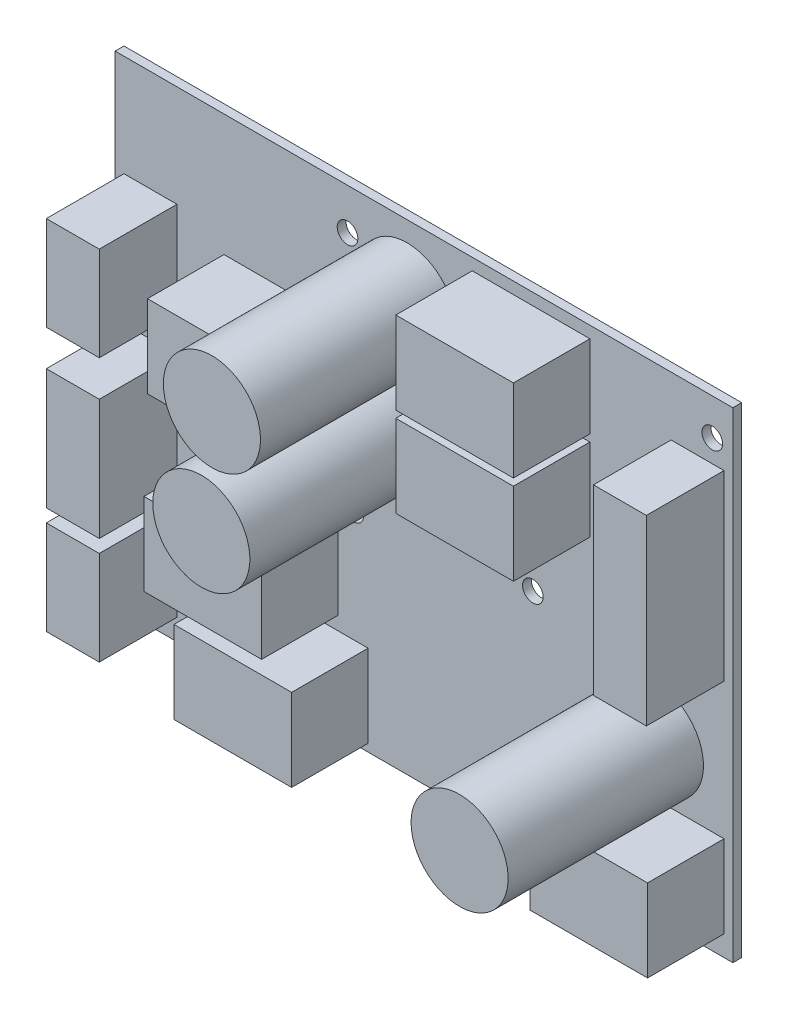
from build123d import *

# Parameters (mm, degrees)
SKICA1_W                = 105
SKICA1_H                = 81.7
SKICA1_R                = 1.75
P_IDAT_VYSUNUT_M1_DEPTH = 1.5
SKICA3_W                = 9
SKICA3_H                = 16
SKICA3_H_2              = 20.5
SKICA3_H_3              = 31
P_IDAT_VYSUNUT_M2_DEPTH = 13.2
SKICA4_W                = 20
SKICA4_H                = 14
P_IDAT_VYSUNUT_M3_DEPTH = 13
SKICA5_R                = 8.25
P_IDAT_VYSUNUT_M7_DEPTH = 33.2


with BuildPart() as part:
    # Skica1 → P_idat vysunut_m1 (new body)
    with BuildSketch(Plane.XY):
        with Locations((-39.694073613, -271.131746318)):
            Rectangle(SKICA1_W, SKICA1_H)
        with Locations((-21.194073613, -274.281746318)):
            Circle(SKICA1_R, mode=Mode.SUBTRACT)
        with Locations((9.305926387, -236.481746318)):
            Circle(SKICA1_R, mode=Mode.SUBTRACT)
        with Locations((-52.694073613, -237.281746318)):
            Circle(SKICA1_R, mode=Mode.SUBTRACT)
        with Locations((-51.694073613, -277.581746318)):
            Circle(SKICA1_R, mode=Mode.SUBTRACT)
    extrude(amount=P_IDAT_VYSUNUT_M1_DEPTH)

    # Skica3 → P_idat vysunut_m2 (add)
    with BuildSketch(Plane.XY.offset(1.5)):
        with Locations((-86.194073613, -255.581746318)):
            Rectangle(SKICA3_W, SKICA3_H)
        with Locations((-86.194073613, -279.931746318)):
            Rectangle(SKICA3_W, SKICA3_H_2)
        with Locations((-86.194073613, -300.381746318)):
            Rectangle(SKICA3_W, SKICA3_H)
        with Locations((6.805926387, -255.781746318)):
            Rectangle(SKICA3_W, SKICA3_H_3)
    extrude(amount=P_IDAT_VYSUNUT_M2_DEPTH)

    # Skica4 → P_idat vysunut_m3 (add)
    with BuildSketch(Plane.XY.offset(1.5)):
        with Locations((-63.694073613, -257.981746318)):
            Rectangle(SKICA4_W, SKICA4_H)
        with Locations((-64.294073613, -287.381746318)):
            Rectangle(SKICA4_W, SKICA4_H)
        with Locations((-59.194073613, -303.681746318)):
            Rectangle(SKICA4_W, SKICA4_H)
        with Locations((-21.494073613, -239.281746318)):
            Rectangle(SKICA4_W, SKICA4_H)
        with Locations((-21.494073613, -254.481746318)):
            Rectangle(SKICA4_W, SKICA4_H)
        with Locations((1.305926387, -301.481746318)):
            Rectangle(SKICA4_W, SKICA4_H)
    extrude(amount=P_IDAT_VYSUNUT_M3_DEPTH)

    # Skica5 → P_idat vysunut_m7 (add)
    with BuildSketch(Plane.XY.offset(1.5)):
        with Locations(Location((-0.444073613, -285.481746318, 0), (0, 0, 180))):
            Circle(SKICA5_R)
        with Locations(Location((-42.544073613, -241.931746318, 0), (0, 0, 180))):
            Circle(SKICA5_R)
        with Locations(Location((-44.344073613, -260.431746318, 0), (0, 0, 180))):
            Circle(SKICA5_R)
    extrude(amount=P_IDAT_VYSUNUT_M7_DEPTH)


solid = part.part
